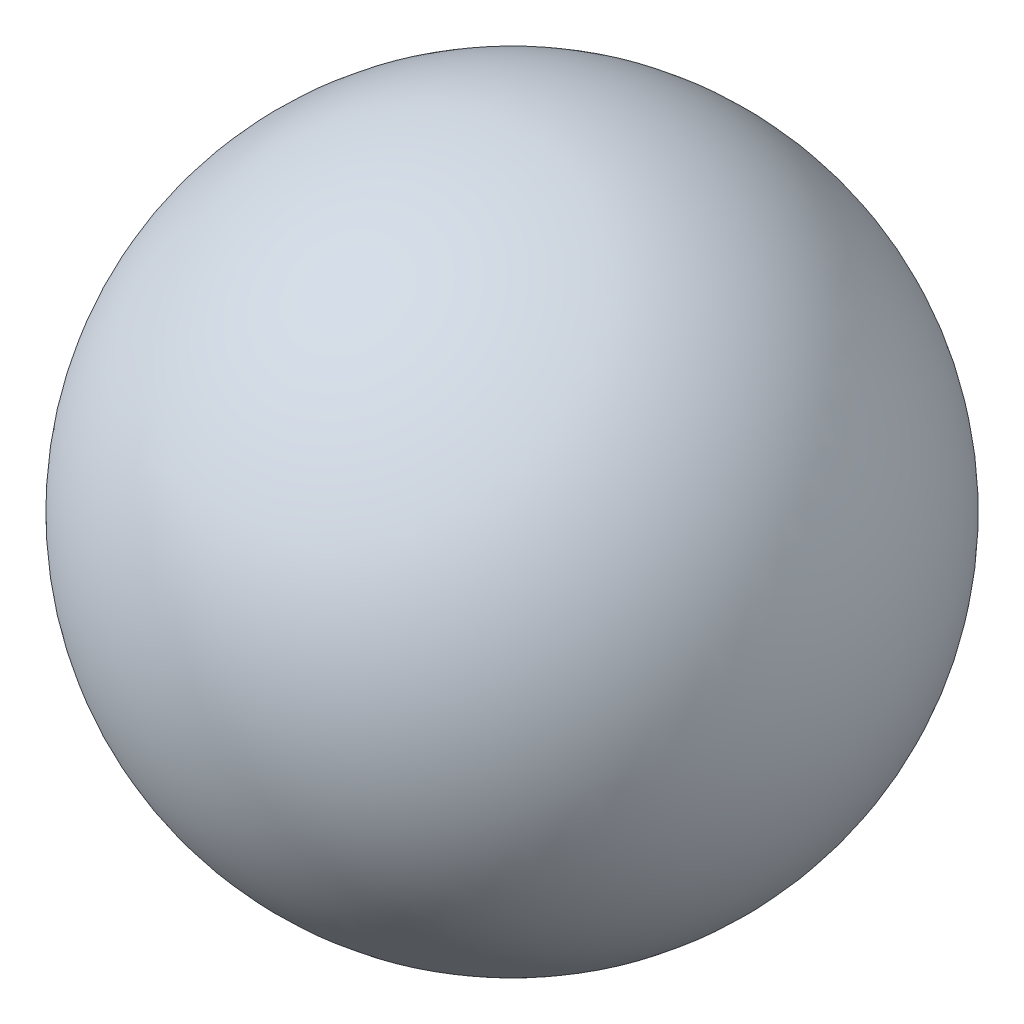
from build123d import *


with BuildPart() as part:
    # Esquisse1 → R_volution1 (revolve)
    with BuildSketch(Plane.XY):
        with BuildLine():
            Line((8.5, 27.3), (8.5, 16.2))
            ThreePointArc((8.5, 16.2), (2.95, 21.75), (8.5, 27.3))
        make_face()
    revolve(axis=Axis((8.5, 31, 0), (0, -1, 0)))


solid = part.part
